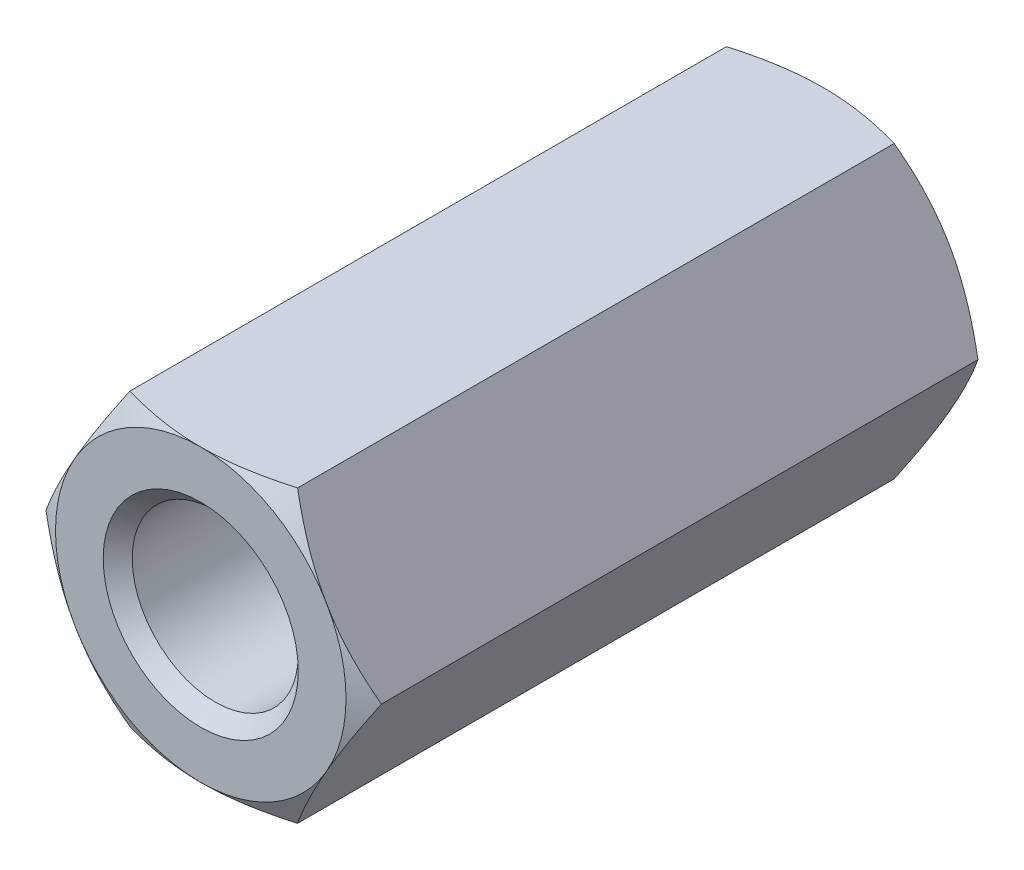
ISO-10303-21;
HEADER;
FILE_DESCRIPTION(('STEP AP214'),'2;1');
FILE_NAME('part.step','',(''),(''),'','','');
FILE_SCHEMA(('AUTOMOTIVE_DESIGN { 1 0 10303 214 1 1 1 1 }'));
ENDSEC;
DATA;
#1=APPLICATION_CONTEXT('core data for automotive mechanical design processes');
#2=APPLICATION_PROTOCOL_DEFINITION('international standard','automotive_design',2000,#1);
#3=PRODUCT_CONTEXT('',#1,'mechanical');
#4=PRODUCT('Part','Part','',(#3));
#5=PRODUCT_RELATED_PRODUCT_CATEGORY('part','',(#4));
#6=PRODUCT_DEFINITION_FORMATION('','',#4);
#7=PRODUCT_DEFINITION_CONTEXT('part definition',#1,'design');
#8=PRODUCT_DEFINITION('design','',#6,#7);
#9=PRODUCT_DEFINITION_SHAPE('','',#8);
#10=(LENGTH_UNIT() NAMED_UNIT(*) SI_UNIT(.MILLI.,.METRE.));
#11=(NAMED_UNIT(*) PLANE_ANGLE_UNIT() SI_UNIT($,.RADIAN.));
#12=(NAMED_UNIT(*) SI_UNIT($,.STERADIAN.) SOLID_ANGLE_UNIT());
#13=UNCERTAINTY_MEASURE_WITH_UNIT(LENGTH_MEASURE(1.E-05),#10,'distance_accuracy_value','');
#14=(GEOMETRIC_REPRESENTATION_CONTEXT(3) GLOBAL_UNCERTAINTY_ASSIGNED_CONTEXT((#13)) GLOBAL_UNIT_ASSIGNED_CONTEXT((#10,
#11,#12)) REPRESENTATION_CONTEXT('',''));
#15=CARTESIAN_POINT('',(0.,0.,0.));
#16=DIRECTION('',(0.,0.,1.));
#17=DIRECTION('',(1.,0.,0.));
#18=AXIS2_PLACEMENT_3D('',#15,#16,#17);
#19=CARTESIAN_POINT('',(4.04145188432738,0.,-7.5));
#20=DIRECTION('',(0.866025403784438,0.5,0.));
#21=DIRECTION('',(-0.5,0.866025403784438,0.));
#22=AXIS2_PLACEMENT_3D('',#19,#20,#21);
#23=PLANE('',#22);
#24=CARTESIAN_POINT('',(4.04156735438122,-0.00019999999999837,7.18732593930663));
#25=CARTESIAN_POINT('',(3.9527667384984,0.153607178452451,7.23861421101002));
#26=CARTESIAN_POINT('',(3.86319960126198,0.308742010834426,7.2852590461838));
#27=CARTESIAN_POINT('',(3.68251437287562,0.621698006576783,7.36667812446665));
#28=CARTESIAN_POINT('',(3.59139307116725,0.779524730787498,7.40142356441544));
#29=CARTESIAN_POINT('',(3.41027974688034,1.09322221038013,7.45550997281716));
#30=CARTESIAN_POINT('',(3.32031559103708,1.24904469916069,7.47521091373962));
#31=CARTESIAN_POINT('',(3.13996396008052,1.56142288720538,7.49872986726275));
#32=CARTESIAN_POINT('',(3.04957714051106,1.71797745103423,7.50256735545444));
#33=CARTESIAN_POINT('',(2.88068384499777,2.01050921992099,7.49458469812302));
#34=CARTESIAN_POINT('',(2.80215208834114,2.14653021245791,7.48472456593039));
#35=CARTESIAN_POINT('',(2.64560020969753,2.417686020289,7.4534735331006));
#36=CARTESIAN_POINT('',(2.5675806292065,2.55281989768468,7.4320719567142));
#37=CARTESIAN_POINT('',(2.41070596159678,2.82453479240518,7.37856959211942));
#38=CARTESIAN_POINT('',(2.33187072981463,2.96108141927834,7.34624200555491));
#39=CARTESIAN_POINT('',(2.17537608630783,3.2321380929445,7.27287106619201));
#40=CARTESIAN_POINT('',(2.09771466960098,3.36665161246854,7.23184495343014));
#41=CARTESIAN_POINT('',(2.02061047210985,3.5002,7.18732593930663));
#42=B_SPLINE_CURVE_WITH_KNOTS('',3,(#24,#25,#26,#27,#28,#29,#30,#31,#32,#33,#34,#35,#36,#37,#38,
#39,#40,#41),.UNSPECIFIED.,.F.,.F.,(4,2,2,2,2,2,2,2,4),(0.,0.554793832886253,1.11092123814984,
1.65328467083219,2.19498204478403,2.6666513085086,3.13875761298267,3.6213361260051,
4.10296698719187),.UNSPECIFIED.);
#43=CARTESIAN_POINT('',(4.04145188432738,0.,7.18739260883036));
#44=VERTEX_POINT('',#43);
#45=CARTESIAN_POINT('',(3.03108891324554,1.75,7.5));
#46=VERTEX_POINT('',#45);
#47=EDGE_CURVE('E127',#44,#46,#42,.T.);
#48=ORIENTED_EDGE('',*,*,#47,.F.);
#49=DIRECTION('',(0.,0.,1.));
#50=VECTOR('',#49,1.);
#51=CARTESIAN_POINT('',(4.04145188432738,0.,-7.5));
#52=LINE('',#51,#50);
#53=CARTESIAN_POINT('',(4.04145188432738,0.,-7.18739260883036));
#54=VERTEX_POINT('',#53);
#55=EDGE_CURVE('E549',#54,#44,#52,.T.);
#56=ORIENTED_EDGE('',*,*,#55,.F.);
#57=CARTESIAN_POINT('',(4.04156735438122,-0.00019999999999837,-7.18732593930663));
#58=CARTESIAN_POINT('',(3.9527667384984,0.153607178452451,-7.23861421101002));
#59=CARTESIAN_POINT('',(3.86319960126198,0.308742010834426,-7.2852590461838));
#60=CARTESIAN_POINT('',(3.68251437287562,0.621698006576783,-7.36667812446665));
#61=CARTESIAN_POINT('',(3.59139307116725,0.779524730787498,-7.40142356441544));
#62=CARTESIAN_POINT('',(3.41027974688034,1.09322221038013,-7.45550997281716));
#63=CARTESIAN_POINT('',(3.32031559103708,1.24904469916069,-7.47521091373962));
#64=CARTESIAN_POINT('',(3.13996396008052,1.56142288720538,-7.49872986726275));
#65=CARTESIAN_POINT('',(3.04957714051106,1.71797745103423,-7.50256735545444));
#66=CARTESIAN_POINT('',(2.88068384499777,2.01050921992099,-7.49458469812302));
#67=CARTESIAN_POINT('',(2.80215208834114,2.14653021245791,-7.48472456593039));
#68=CARTESIAN_POINT('',(2.64560020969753,2.417686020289,-7.4534735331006));
#69=CARTESIAN_POINT('',(2.5675806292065,2.55281989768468,-7.4320719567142));
#70=CARTESIAN_POINT('',(2.41070596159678,2.82453479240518,-7.37856959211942));
#71=CARTESIAN_POINT('',(2.33187072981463,2.96108141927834,-7.34624200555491));
#72=CARTESIAN_POINT('',(2.17537608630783,3.2321380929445,-7.27287106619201));
#73=CARTESIAN_POINT('',(2.09771466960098,3.36665161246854,-7.23184495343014));
#74=CARTESIAN_POINT('',(2.02061047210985,3.5002,-7.18732593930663));
#75=B_SPLINE_CURVE_WITH_KNOTS('',3,(#57,#58,#59,#60,#61,#62,#63,#64,#65,#66,#67,#68,#69,#70,#71,
#72,#73,#74),.UNSPECIFIED.,.F.,.F.,(4,2,2,2,2,2,2,2,4),(0.,0.554793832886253,1.11092123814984,
1.65328467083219,2.19498204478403,2.6666513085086,3.13875761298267,3.6213361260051,
4.10296698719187),.UNSPECIFIED.);
#76=CARTESIAN_POINT('',(3.03108891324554,1.75,-7.5));
#77=VERTEX_POINT('',#76);
#78=EDGE_CURVE('E530',#54,#77,#75,.T.);
#79=ORIENTED_EDGE('',*,*,#78,.T.);
#80=CARTESIAN_POINT('',(2.02072594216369,3.5,-7.18739260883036));
#81=VERTEX_POINT('',#80);
#82=EDGE_CURVE('E268',#77,#81,#75,.T.);
#83=ORIENTED_EDGE('',*,*,#82,.T.);
#84=DIRECTION('',(0.,0.,1.));
#85=VECTOR('',#84,1.);
#86=CARTESIAN_POINT('',(2.02072594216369,3.5,-7.5));
#87=LINE('',#86,#85);
#88=CARTESIAN_POINT('',(2.02072594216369,3.5,7.18739260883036));
#89=VERTEX_POINT('',#88);
#90=EDGE_CURVE('E159',#81,#89,#87,.T.);
#91=ORIENTED_EDGE('',*,*,#90,.T.);
#92=EDGE_CURVE('E140',#46,#89,#42,.T.);
#93=ORIENTED_EDGE('',*,*,#92,.F.);
#94=EDGE_LOOP('',(#48,#56,#79,#83,#91,#93));
#95=FACE_BOUND('',#94,.T.);
#96=ADVANCED_FACE('F41',(#95),#23,.T.);
#97=CARTESIAN_POINT('',(2.02072594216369,-3.5,-7.5));
#98=DIRECTION('',(0.866025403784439,-0.5,0.));
#99=DIRECTION('',(0.5,0.866025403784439,0.));
#100=AXIS2_PLACEMENT_3D('',#97,#98,#99);
#101=PLANE('',#100);
#102=CARTESIAN_POINT('',(2.02061047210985,-3.5002,7.18732593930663));
#103=CARTESIAN_POINT('',(2.10941108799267,-3.34639282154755,7.23861421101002));
#104=CARTESIAN_POINT('',(2.19897822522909,-3.19125798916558,7.2852590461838));
#105=CARTESIAN_POINT('',(2.37966345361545,-2.87830199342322,7.36667812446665));
#106=CARTESIAN_POINT('',(2.47078475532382,-2.7204752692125,7.40142356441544));
#107=CARTESIAN_POINT('',(2.65189807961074,-2.40677778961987,7.45550997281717));
#108=CARTESIAN_POINT('',(2.74186223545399,-2.25095530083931,7.47521091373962));
#109=CARTESIAN_POINT('',(2.92221386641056,-1.93857711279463,7.49872986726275));
#110=CARTESIAN_POINT('',(3.01260068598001,-1.78202254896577,7.50256735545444));
#111=CARTESIAN_POINT('',(3.1814939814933,-1.48949078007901,7.49458469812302));
#112=CARTESIAN_POINT('',(3.26002573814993,-1.35346978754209,7.48472456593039));
#113=CARTESIAN_POINT('',(3.41657761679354,-1.082313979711,7.4534735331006));
#114=CARTESIAN_POINT('',(3.49459719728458,-0.947180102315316,7.4320719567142));
#115=CARTESIAN_POINT('',(3.65147186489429,-0.675465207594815,7.37856959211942));
#116=CARTESIAN_POINT('',(3.73030709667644,-0.538918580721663,7.34624200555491));
#117=CARTESIAN_POINT('',(3.88680174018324,-0.267861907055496,7.27287106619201));
#118=CARTESIAN_POINT('',(3.96446315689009,-0.133348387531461,7.23184495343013));
#119=CARTESIAN_POINT('',(4.04156735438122,0.000200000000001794,7.18732593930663));
#120=B_SPLINE_CURVE_WITH_KNOTS('',3,(#102,#103,#104,#105,#106,#107,#108,#109,#110,#111,#112,
#113,#114,#115,#116,#117,#118,#119),.UNSPECIFIED.,.F.,.F.,(4,2,2,2,2,2,2,2,4),(0.,
0.554793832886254,1.11092123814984,1.65328467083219,2.19498204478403,2.6666513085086,
3.13875761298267,3.6213361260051,4.10296698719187),.UNSPECIFIED.);
#121=CARTESIAN_POINT('',(2.02072594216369,-3.5,7.18739260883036));
#122=VERTEX_POINT('',#121);
#123=CARTESIAN_POINT('',(3.03108891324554,-1.75,7.5));
#124=VERTEX_POINT('',#123);
#125=EDGE_CURVE('E576',#122,#124,#120,.T.);
#126=ORIENTED_EDGE('',*,*,#125,.F.);
#127=DIRECTION('',(0.,0.,1.));
#128=VECTOR('',#127,1.);
#129=CARTESIAN_POINT('',(2.02072594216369,-3.5,-7.5));
#130=LINE('',#129,#128);
#131=CARTESIAN_POINT('',(2.02072594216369,-3.5,-7.18739260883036));
#132=VERTEX_POINT('',#131);
#133=EDGE_CURVE('E282',#132,#122,#130,.T.);
#134=ORIENTED_EDGE('',*,*,#133,.F.);
#135=CARTESIAN_POINT('',(2.02061047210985,-3.5002,-7.18732593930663));
#136=CARTESIAN_POINT('',(2.10941108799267,-3.34639282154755,-7.23861421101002));
#137=CARTESIAN_POINT('',(2.19897822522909,-3.19125798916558,-7.2852590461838));
#138=CARTESIAN_POINT('',(2.37966345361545,-2.87830199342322,-7.36667812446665));
#139=CARTESIAN_POINT('',(2.47078475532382,-2.7204752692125,-7.40142356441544));
#140=CARTESIAN_POINT('',(2.65189807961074,-2.40677778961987,-7.45550997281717));
#141=CARTESIAN_POINT('',(2.74186223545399,-2.25095530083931,-7.47521091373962));
#142=CARTESIAN_POINT('',(2.92221386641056,-1.93857711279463,-7.49872986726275));
#143=CARTESIAN_POINT('',(3.01260068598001,-1.78202254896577,-7.50256735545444));
#144=CARTESIAN_POINT('',(3.1814939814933,-1.48949078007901,-7.49458469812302));
#145=CARTESIAN_POINT('',(3.26002573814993,-1.35346978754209,-7.48472456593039));
#146=CARTESIAN_POINT('',(3.41657761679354,-1.082313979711,-7.4534735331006));
#147=CARTESIAN_POINT('',(3.49459719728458,-0.947180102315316,-7.4320719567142));
#148=CARTESIAN_POINT('',(3.65147186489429,-0.675465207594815,-7.37856959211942));
#149=CARTESIAN_POINT('',(3.73030709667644,-0.538918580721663,-7.34624200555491));
#150=CARTESIAN_POINT('',(3.88680174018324,-0.267861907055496,-7.27287106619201));
#151=CARTESIAN_POINT('',(3.96446315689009,-0.133348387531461,-7.23184495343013));
#152=CARTESIAN_POINT('',(4.04156735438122,0.000200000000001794,-7.18732593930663));
#153=B_SPLINE_CURVE_WITH_KNOTS('',3,(#135,#136,#137,#138,#139,#140,#141,#142,#143,#144,#145,
#146,#147,#148,#149,#150,#151,#152),.UNSPECIFIED.,.F.,.F.,(4,2,2,2,2,2,2,2,4),(0.,
0.554793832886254,1.11092123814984,1.65328467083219,2.19498204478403,2.6666513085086,
3.13875761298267,3.6213361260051,4.10296698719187),.UNSPECIFIED.);
#154=CARTESIAN_POINT('',(3.03108891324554,-1.75,-7.5));
#155=VERTEX_POINT('',#154);
#156=EDGE_CURVE('E528',#132,#155,#153,.T.);
#157=ORIENTED_EDGE('',*,*,#156,.T.);
#158=EDGE_CURVE('E283',#155,#54,#153,.T.);
#159=ORIENTED_EDGE('',*,*,#158,.T.);
#160=ORIENTED_EDGE('',*,*,#55,.T.);
#161=EDGE_CURVE('E132',#124,#44,#120,.T.);
#162=ORIENTED_EDGE('',*,*,#161,.F.);
#163=EDGE_LOOP('',(#126,#134,#157,#159,#160,#162));
#164=FACE_BOUND('',#163,.T.);
#165=ADVANCED_FACE('F253',(#164),#101,.T.);
#166=CARTESIAN_POINT('',(-2.02072594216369,-3.5,-7.5));
#167=DIRECTION('',(0.,-1.,0.));
#168=DIRECTION('',(1.,0.,0.));
#169=AXIS2_PLACEMENT_3D('',#166,#167,#168);
#170=PLANE('',#169);
#171=CARTESIAN_POINT('',(-13.93909338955,-3.50000000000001,1.22316958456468));
#172=CARTESIAN_POINT('',(-13.6340370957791,-3.50000000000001,1.3939836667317));
#173=CARTESIAN_POINT('',(-13.328844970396,-3.5,1.56455582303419));
#174=CARTESIAN_POINT('',(-12.7181143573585,-3.5,1.90508295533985));
#175=CARTESIAN_POINT('',(-12.412575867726,-3.5,2.07503792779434));
#176=CARTESIAN_POINT('',(-11.8010010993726,-3.5,2.41423989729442));
#177=CARTESIAN_POINT('',(-11.4949647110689,-3.5,2.58348669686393));
#178=CARTESIAN_POINT('',(-10.8823730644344,-3.5,2.92103734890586));
#179=CARTESIAN_POINT('',(-10.5758178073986,-3.5,3.08934120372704));
#180=CARTESIAN_POINT('',(-9.96272869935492,-3.5,3.42438286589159));
#181=CARTESIAN_POINT('',(-9.65619628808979,-3.5,3.59112330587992));
#182=CARTESIAN_POINT('',(-9.04229742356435,-3.5,3.92306138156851));
#183=CARTESIAN_POINT('',(-8.73493097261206,-3.5,4.0882590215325));
#184=CARTESIAN_POINT('',(-8.11914738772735,-3.5,4.4165906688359));
#185=CARTESIAN_POINT('',(-7.8107303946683,-3.5,4.57972494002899));
#186=CARTESIAN_POINT('',(-7.19244579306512,-3.5,4.90321772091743));
#187=CARTESIAN_POINT('',(-6.88257820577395,-3.5,5.06357627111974));
#188=CARTESIAN_POINT('',(-6.26306488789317,-3.5,5.37927240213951));
#189=CARTESIAN_POINT('',(-5.95343325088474,-3.5,5.53463757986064));
#190=CARTESIAN_POINT('',(-5.33137168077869,-3.5,5.83985440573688));
#191=CARTESIAN_POINT('',(-5.01894126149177,-3.5,5.98970507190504));
#192=CARTESIAN_POINT('',(-4.54653144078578,-3.5,6.20851819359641));
#193=CARTESIAN_POINT('',(-4.388017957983,-3.5,6.28064138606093));
#194=CARTESIAN_POINT('',(-4.06979128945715,-3.5,6.42218453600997));
#195=CARTESIAN_POINT('',(-3.91007814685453,-3.5,6.49160459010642));
#196=CARTESIAN_POINT('',(-3.58923189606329,-3.5,6.62701995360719));
#197=CARTESIAN_POINT('',(-3.42809904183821,-3.5,6.6930158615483));
#198=CARTESIAN_POINT('',(-3.10411792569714,-3.5,6.82063180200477));
#199=CARTESIAN_POINT('',(-2.9412697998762,-3.5,6.88225217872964));
#200=CARTESIAN_POINT('',(-2.57330185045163,-3.5,7.0143159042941));
#201=CARTESIAN_POINT('',(-2.36761759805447,-3.5,7.08321234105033));
#202=CARTESIAN_POINT('',(-1.95256058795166,-3.5,7.20906629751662));
#203=CARTESIAN_POINT('',(-1.74318771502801,-3.5,7.26602344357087));
#204=CARTESIAN_POINT('',(-1.32302041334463,-3.5,7.36326256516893));
#205=CARTESIAN_POINT('',(-1.11227086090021,-3.5,7.40373082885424));
#206=CARTESIAN_POINT('',(-0.79404941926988,-3.5,7.44950044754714));
#207=CARTESIAN_POINT('',(-0.687633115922,-3.5,7.46226784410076));
#208=CARTESIAN_POINT('',(-0.474299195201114,-3.5,7.48243383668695));
#209=CARTESIAN_POINT('',(-0.36738165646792,-3.5,7.48983324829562));
#210=CARTESIAN_POINT('',(-0.151941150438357,-3.5,7.4990600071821));
#211=CARTESIAN_POINT('',(-0.0434150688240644,-3.5,7.50081524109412));
#212=CARTESIAN_POINT('',(0.173574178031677,-3.5,7.49848616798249));
#213=CARTESIAN_POINT('',(0.282037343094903,-3.5,7.49440184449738));
#214=CARTESIAN_POINT('',(0.498618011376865,-3.5,7.480543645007));
#215=CARTESIAN_POINT('',(0.606735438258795,-3.5,7.47076858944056));
#216=CARTESIAN_POINT('',(0.822348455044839,-3.5,7.44586892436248));
#217=CARTESIAN_POINT('',(0.929844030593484,-3.5,7.4307441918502));
#218=CARTESIAN_POINT('',(1.14527612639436,-3.5,7.39541323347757));
#219=CARTESIAN_POINT('',(1.25320318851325,-3.5,7.37514984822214));
#220=CARTESIAN_POINT('',(1.46812360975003,-3.5,7.33018935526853));
#221=CARTESIAN_POINT('',(1.57511695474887,-3.5,7.30549218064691));
#222=CARTESIAN_POINT('',(1.78815137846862,-3.5,7.25222711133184));
#223=CARTESIAN_POINT('',(1.89419226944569,-3.5,7.22365847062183));
#224=CARTESIAN_POINT('',(2.10530694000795,-3.5,7.16319017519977));
#225=CARTESIAN_POINT('',(2.21038077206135,-3.5,7.13129070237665));
#226=CARTESIAN_POINT('',(2.51184829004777,-3.5,7.03527758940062));
#227=CARTESIAN_POINT('',(2.70709295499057,-3.5,6.9675545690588));
#228=CARTESIAN_POINT('',(3.09486410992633,-3.5,6.82468449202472));
#229=CARTESIAN_POINT('',(3.28738980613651,-3.5,6.74953531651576));
#230=CARTESIAN_POINT('',(3.67037650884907,-3.5,6.59365624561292));
#231=CARTESIAN_POINT('',(3.86083529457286,-3.5,6.51292092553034));
#232=CARTESIAN_POINT('',(4.23991407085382,-3.5,6.34731909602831));
#233=CARTESIAN_POINT('',(4.42853424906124,-3.5,6.2624530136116));
#234=CARTESIAN_POINT('',(4.80483432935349,-3.5,6.08932784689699));
#235=CARTESIAN_POINT('',(4.99251022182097,-3.5,6.00106007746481));
#236=CARTESIAN_POINT('',(5.36668445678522,-3.5,5.82206064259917));
#237=CARTESIAN_POINT('',(5.55318277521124,-3.5,5.73132892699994));
#238=CARTESIAN_POINT('',(6.11104952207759,-3.5,5.45636200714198));
#239=CARTESIAN_POINT('',(6.48100139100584,-3.5,5.26925607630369));
#240=CARTESIAN_POINT('',(7.21924313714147,-3.5,4.8896905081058));
#241=CARTESIAN_POINT('',(7.58752697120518,-3.5,4.69721919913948));
#242=CARTESIAN_POINT('',(8.32236027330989,-3.5,4.30888661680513));
#243=CARTESIAN_POINT('',(8.68890951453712,-3.5,4.11302491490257));
#244=CARTESIAN_POINT('',(9.42018483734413,-3.5,3.71921501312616));
#245=CARTESIAN_POINT('',(9.78491281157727,-3.5,3.52127032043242));
#246=CARTESIAN_POINT('',(10.5134214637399,-3.5,3.1236447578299));
#247=CARTESIAN_POINT('',(10.8772021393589,-3.5,2.92396388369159));
#248=CARTESIAN_POINT('',(11.4663032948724,-3.5,2.59922228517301));
#249=CARTESIAN_POINT('',(11.6918455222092,-3.5,2.47456335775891));
#250=CARTESIAN_POINT('',(12.1427515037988,-3.5,2.22478250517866));
#251=CARTESIAN_POINT('',(12.368115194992,-3.5,2.09966046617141));
#252=CARTESIAN_POINT('',(12.8178779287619,-3.5,1.84947273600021));
#253=CARTESIAN_POINT('',(13.0422776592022,-3.5,1.72440828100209));
#254=CARTESIAN_POINT('',(13.4908410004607,-3.5,1.4739969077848));
#255=CARTESIAN_POINT('',(13.7150046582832,-3.5,1.34865007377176));
#256=CARTESIAN_POINT('',(13.93909338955,-3.5,1.22316958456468));
#257=B_SPLINE_CURVE_WITH_KNOTS('',3,(#171,#172,#173,#174,#175,#176,#177,#178,#179,#180,#181,
#182,#183,#184,#185,#186,#187,#188,#189,#190,#191,#192,#193,#194,#195,#196,#197,#198,#199,#200,
#201,#202,#203,#204,#205,#206,#207,#208,#209,#210,#211,#212,#213,#214,#215,#216,#217,#218,#219,
#220,#221,#222,#223,#224,#225,#226,#227,#228,#229,#230,#231,#232,#233,#234,#235,#236,#237,#238,
#239,#240,#241,#242,#243,#244,#245,#246,#247,#248,#249,#250,#251,#252,#253,#254,#255,#256),
.UNSPECIFIED.,.F.,.F.,(4,2,2,2,2,2,2,2,2,2,2,2,2,2,2,2,2,2,2,2,2,2,2,2,2,2,2,2,2,2,2,2,2,2,2,2,
2,2,2,2,2,2,4),(0.,1.04887173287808,2.09774948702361,3.14690246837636,4.19605283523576,
5.24289261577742,6.28972950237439,7.33643114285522,8.383117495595,9.4223602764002,
10.4617872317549,10.9842185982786,11.5066312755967,12.0289523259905,12.551232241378,
13.2017093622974,13.8522068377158,14.4951364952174,14.8165592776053,15.1379332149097,
15.4633972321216,15.788862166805,16.1143945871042,16.4399344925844,16.7692678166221,
17.0986061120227,17.4280079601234,17.7573918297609,18.3771299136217,18.9970453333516,
19.6175714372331,20.2380335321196,20.8602010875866,21.4823813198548,22.726041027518,
23.9726577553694,25.2194332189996,26.464368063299,27.7093059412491,28.482404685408,
29.2557081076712,30.0264005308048,30.7968874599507),.UNSPECIFIED.);
#258=CARTESIAN_POINT('',(-2.02072594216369,-3.5,7.18739260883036));
#259=VERTEX_POINT('',#258);
#260=CARTESIAN_POINT('',(0.,-3.5,7.5));
#261=VERTEX_POINT('',#260);
#262=EDGE_CURVE('E577',#259,#261,#257,.T.);
#263=ORIENTED_EDGE('',*,*,#262,.F.);
#264=DIRECTION('',(0.,0.,1.));
#265=VECTOR('',#264,1.);
#266=CARTESIAN_POINT('',(-2.02072594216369,-3.5,-7.5));
#267=LINE('',#266,#265);
#268=CARTESIAN_POINT('',(-2.02072594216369,-3.5,-7.18739260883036));
#269=VERTEX_POINT('',#268);
#270=EDGE_CURVE('E544',#269,#259,#267,.T.);
#271=ORIENTED_EDGE('',*,*,#270,.F.);
#272=CARTESIAN_POINT('',(-9.33049178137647,-3.5,-3.76723202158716));
#273=CARTESIAN_POINT('',(-9.12157214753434,-3.5,-3.88015785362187));
#274=CARTESIAN_POINT('',(-8.91246384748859,-3.5,-3.99273652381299));
#275=CARTESIAN_POINT('',(-8.49377211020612,-3.5,-4.21701727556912));
#276=CARTESIAN_POINT('',(-8.28418866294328,-3.5,-4.32871933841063));
#277=CARTESIAN_POINT('',(-7.8642827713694,-3.5,-4.5511524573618));
#278=CARTESIAN_POINT('',(-7.65395985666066,-3.5,-4.66188262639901));
#279=CARTESIAN_POINT('',(-7.23262389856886,-3.5,-4.88201911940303));
#280=CARTESIAN_POINT('',(-7.02161086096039,-3.5,-4.99142545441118));
#281=CARTESIAN_POINT('',(-6.59086219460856,-3.5,-5.21261713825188));
#282=CARTESIAN_POINT('',(-6.37109417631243,-3.5,-5.32433951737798));
#283=CARTESIAN_POINT('',(-5.9304017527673,-3.5,-5.54547846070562));
#284=CARTESIAN_POINT('',(-5.70947736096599,-3.5,-5.65489505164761));
#285=CARTESIAN_POINT('',(-5.26622241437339,-3.5,-5.87066288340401));
#286=CARTESIAN_POINT('',(-5.04389234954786,-3.5,-5.97701512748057));
#287=CARTESIAN_POINT('',(-4.59733510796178,-3.5,-6.18564648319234));
#288=CARTESIAN_POINT('',(-4.3731080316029,-3.5,-6.28792580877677));
#289=CARTESIAN_POINT('',(-3.91084029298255,-3.5,-6.49190379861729));
#290=CARTESIAN_POINT('',(-3.67267177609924,-3.5,-6.59331491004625));
#291=CARTESIAN_POINT('',(-3.19266309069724,-3.5,-6.7873707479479));
#292=CARTESIAN_POINT('',(-2.95082188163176,-3.5,-6.88001293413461));
#293=CARTESIAN_POINT('',(-2.46512134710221,-3.5,-7.0515649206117));
#294=CARTESIAN_POINT('',(-2.2213105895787,-3.5,-7.13060987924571));
#295=CARTESIAN_POINT('',(-1.72844756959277,-3.5,-7.27041855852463));
#296=CARTESIAN_POINT('',(-1.47939830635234,-3.5,-7.33119245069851));
#297=CARTESIAN_POINT('',(-1.03659094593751,-3.5,-7.41580892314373));
#298=CARTESIAN_POINT('',(-0.843878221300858,-3.5,-7.44501080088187));
#299=CARTESIAN_POINT('',(-0.456608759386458,-3.5,-7.4858342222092));
#300=CARTESIAN_POINT('',(-0.262052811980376,-3.5,-7.49746298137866));
#301=CARTESIAN_POINT('',(0.127275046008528,-3.5,-7.50178797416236));
#302=CARTESIAN_POINT('',(0.322046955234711,-3.5,-7.49448432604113));
#303=CARTESIAN_POINT('',(0.710055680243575,-3.5,-7.46182228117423));
#304=CARTESIAN_POINT('',(0.903292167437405,-3.5,-7.43646011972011));
#305=CARTESIAN_POINT('',(1.29192554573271,-3.5,-7.36946918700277));
#306=CARTESIAN_POINT('',(1.48725172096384,-3.5,-7.32744180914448));
#307=CARTESIAN_POINT('',(1.87472606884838,-3.5,-7.23060011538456));
#308=CARTESIAN_POINT('',(2.06687275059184,-3.5,-7.1757799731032));
#309=CARTESIAN_POINT('',(2.44856990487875,-3.5,-7.05633300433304));
#310=CARTESIAN_POINT('',(2.63811272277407,-3.5,-6.99168210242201));
#311=CARTESIAN_POINT('',(3.01450726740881,-3.5,-6.85515357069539));
#312=CARTESIAN_POINT('',(3.20135949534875,-3.5,-6.78327730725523));
#313=CARTESIAN_POINT('',(3.57599656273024,-3.5,-6.63285827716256));
#314=CARTESIAN_POINT('',(3.76374428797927,-3.5,-6.55422376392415));
#315=CARTESIAN_POINT('',(4.13741474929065,-3.5,-6.39274115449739));
#316=CARTESIAN_POINT('',(4.32333743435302,-3.5,-6.30989294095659));
#317=CARTESIAN_POINT('',(4.69345130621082,-3.5,-6.14109919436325));
#318=CARTESIAN_POINT('',(4.8776445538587,-3.5,-6.05515816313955));
#319=CARTESIAN_POINT('',(5.24484143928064,-3.5,-5.88078593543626));
#320=CARTESIAN_POINT('',(5.42784509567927,-3.5,-5.79235477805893));
#321=CARTESIAN_POINT('',(5.92869014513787,-3.5,-5.54702822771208));
#322=CARTESIAN_POINT('',(6.245555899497,-3.5,-5.38814334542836));
#323=CARTESIAN_POINT('',(6.87734173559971,-3.5,-5.0662942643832));
#324=CARTESIAN_POINT('',(7.19226107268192,-3.5,-4.90332861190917));
#325=CARTESIAN_POINT('',(7.8116992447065,-3.5,-4.5792039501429));
#326=CARTESIAN_POINT('',(8.11625987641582,-3.5,-4.41812465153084));
#327=CARTESIAN_POINT('',(8.72416943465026,-3.5,-4.09400216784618));
#328=CARTESIAN_POINT('',(9.02751882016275,-3.5,-3.93095984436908));
#329=CARTESIAN_POINT('',(9.33049178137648,-3.5,-3.76723202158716));
#330=B_SPLINE_CURVE_WITH_KNOTS('',3,(#272,#273,#274,#275,#276,#277,#278,#279,#280,#281,#282,
#283,#284,#285,#286,#287,#288,#289,#290,#291,#292,#293,#294,#295,#296,#297,#298,#299,#300,#301,
#302,#303,#304,#305,#306,#307,#308,#309,#310,#311,#312,#313,#314,#315,#316,#317,#318,#319,#320,
#321,#322,#323,#324,#325,#326,#327,#328,#329),.UNSPECIFIED.,.F.,.F.,(4,2,2,2,2,2,2,2,2,2,2,2,2,
2,2,2,2,2,2,2,2,2,2,2,2,2,2,2,4),(0.,0.712459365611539,1.42493390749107,2.13800238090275,
2.85106490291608,3.59066178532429,4.33025008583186,5.06959342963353,5.80889788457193,
6.58536007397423,7.36204651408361,8.13049979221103,8.89852447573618,9.48258230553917,
10.0664002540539,10.6502145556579,11.2341506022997,11.8329887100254,12.4321000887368,
13.032703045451,13.6331926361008,14.24377549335,14.854375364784,15.464119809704,
16.0738546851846,17.1372136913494,18.2009570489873,19.2345504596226,20.2677056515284),.UNSPECIFIED.);
#331=CARTESIAN_POINT('',(0.,-3.5,-7.5));
#332=VERTEX_POINT('',#331);
#333=EDGE_CURVE('E553',#269,#332,#330,.T.);
#334=ORIENTED_EDGE('',*,*,#333,.T.);
#335=EDGE_CURVE('E258',#332,#132,#330,.T.);
#336=ORIENTED_EDGE('',*,*,#335,.T.);
#337=ORIENTED_EDGE('',*,*,#133,.T.);
#338=EDGE_CURVE('E138',#261,#122,#257,.T.);
#339=ORIENTED_EDGE('',*,*,#338,.F.);
#340=EDGE_LOOP('',(#263,#271,#334,#336,#337,#339));
#341=FACE_BOUND('',#340,.T.);
#342=ADVANCED_FACE('F291',(#341),#170,.T.);
#343=CARTESIAN_POINT('',(-4.04145188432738,0.,-7.5));
#344=DIRECTION('',(-0.866025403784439,-0.5,0.));
#345=DIRECTION('',(0.5,-0.866025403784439,0.));
#346=AXIS2_PLACEMENT_3D('',#343,#344,#345);
#347=PLANE('',#346);
#348=CARTESIAN_POINT('',(-4.04156735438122,0.000199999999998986,7.18732593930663));
#349=CARTESIAN_POINT('',(-3.9527667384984,-0.15360717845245,7.23861421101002));
#350=CARTESIAN_POINT('',(-3.86319960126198,-0.308742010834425,7.28525904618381));
#351=CARTESIAN_POINT('',(-3.68251437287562,-0.621698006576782,7.36667812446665));
#352=CARTESIAN_POINT('',(-3.59139307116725,-0.779524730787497,7.40142356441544));
#353=CARTESIAN_POINT('',(-3.41027974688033,-1.09322221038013,7.45550997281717));
#354=CARTESIAN_POINT('',(-3.32031559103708,-1.24904469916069,7.47521091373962));
#355=CARTESIAN_POINT('',(-3.13996396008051,-1.56142288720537,7.49872986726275));
#356=CARTESIAN_POINT('',(-3.04957714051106,-1.71797745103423,7.50256735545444));
#357=CARTESIAN_POINT('',(-2.88068384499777,-2.01050921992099,7.49458469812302));
#358=CARTESIAN_POINT('',(-2.80215208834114,-2.14653021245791,7.48472456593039));
#359=CARTESIAN_POINT('',(-2.64560020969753,-2.41768602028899,7.4534735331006));
#360=CARTESIAN_POINT('',(-2.56758062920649,-2.55281989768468,7.4320719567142));
#361=CARTESIAN_POINT('',(-2.41070596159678,-2.82453479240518,7.37856959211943));
#362=CARTESIAN_POINT('',(-2.33187072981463,-2.96108141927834,7.34624200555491));
#363=CARTESIAN_POINT('',(-2.17537608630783,-3.2321380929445,7.27287106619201));
#364=CARTESIAN_POINT('',(-2.09771466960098,-3.36665161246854,7.23184495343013));
#365=CARTESIAN_POINT('',(-2.02061047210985,-3.5002,7.18732593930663));
#366=B_SPLINE_CURVE_WITH_KNOTS('',3,(#348,#349,#350,#351,#352,#353,#354,#355,#356,#357,#358,
#359,#360,#361,#362,#363,#364,#365),.UNSPECIFIED.,.F.,.F.,(4,2,2,2,2,2,2,2,4),(0.,
0.554793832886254,1.11092123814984,1.65328467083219,2.19498204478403,2.6666513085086,
3.13875761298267,3.6213361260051,4.10296698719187),.UNSPECIFIED.);
#367=CARTESIAN_POINT('',(-4.04145188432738,0.,7.18739260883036));
#368=VERTEX_POINT('',#367);
#369=CARTESIAN_POINT('',(-3.03108891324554,-1.75,7.5));
#370=VERTEX_POINT('',#369);
#371=EDGE_CURVE('E175',#368,#370,#366,.T.);
#372=ORIENTED_EDGE('',*,*,#371,.F.);
#373=DIRECTION('',(0.,0.,1.));
#374=VECTOR('',#373,1.);
#375=CARTESIAN_POINT('',(-4.04145188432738,0.,-7.5));
#376=LINE('',#375,#374);
#377=CARTESIAN_POINT('',(-4.04145188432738,0.,-7.18739260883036));
#378=VERTEX_POINT('',#377);
#379=EDGE_CURVE('E541',#378,#368,#376,.T.);
#380=ORIENTED_EDGE('',*,*,#379,.F.);
#381=CARTESIAN_POINT('',(-4.04156735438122,0.000199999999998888,-7.18732593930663));
#382=CARTESIAN_POINT('',(-3.9527667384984,-0.15360717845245,-7.23861421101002));
#383=CARTESIAN_POINT('',(-3.86319960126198,-0.308742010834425,-7.28525904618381));
#384=CARTESIAN_POINT('',(-3.68251437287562,-0.621698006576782,-7.36667812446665));
#385=CARTESIAN_POINT('',(-3.59139307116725,-0.779524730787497,-7.40142356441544));
#386=CARTESIAN_POINT('',(-3.41027974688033,-1.09322221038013,-7.45550997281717));
#387=CARTESIAN_POINT('',(-3.32031559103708,-1.24904469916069,-7.47521091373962));
#388=CARTESIAN_POINT('',(-3.13996396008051,-1.56142288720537,-7.49872986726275));
#389=CARTESIAN_POINT('',(-3.04957714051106,-1.71797745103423,-7.50256735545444));
#390=CARTESIAN_POINT('',(-2.88068384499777,-2.01050921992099,-7.49458469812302));
#391=CARTESIAN_POINT('',(-2.80215208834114,-2.14653021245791,-7.48472456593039));
#392=CARTESIAN_POINT('',(-2.64560020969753,-2.417686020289,-7.4534735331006));
#393=CARTESIAN_POINT('',(-2.56758062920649,-2.55281989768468,-7.4320719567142));
#394=CARTESIAN_POINT('',(-2.41070596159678,-2.82453479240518,-7.37856959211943));
#395=CARTESIAN_POINT('',(-2.33187072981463,-2.96108141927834,-7.34624200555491));
#396=CARTESIAN_POINT('',(-2.17537608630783,-3.2321380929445,-7.27287106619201));
#397=CARTESIAN_POINT('',(-2.09771466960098,-3.36665161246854,-7.23184495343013));
#398=CARTESIAN_POINT('',(-2.02061047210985,-3.5002,-7.18732593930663));
#399=B_SPLINE_CURVE_WITH_KNOTS('',3,(#381,#382,#383,#384,#385,#386,#387,#388,#389,#390,#391,
#392,#393,#394,#395,#396,#397,#398),.UNSPECIFIED.,.F.,.F.,(4,2,2,2,2,2,2,2,4),(0.,
0.554793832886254,1.11092123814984,1.65328467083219,2.19498204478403,2.6666513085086,
3.13875761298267,3.6213361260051,4.10296698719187),.UNSPECIFIED.);
#400=CARTESIAN_POINT('',(-3.03108891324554,-1.75,-7.5));
#401=VERTEX_POINT('',#400);
#402=EDGE_CURVE('E274',#378,#401,#399,.T.);
#403=ORIENTED_EDGE('',*,*,#402,.T.);
#404=EDGE_CURVE('E281',#401,#269,#399,.T.);
#405=ORIENTED_EDGE('',*,*,#404,.T.);
#406=ORIENTED_EDGE('',*,*,#270,.T.);
#407=EDGE_CURVE('E575',#370,#259,#366,.T.);
#408=ORIENTED_EDGE('',*,*,#407,.F.);
#409=EDGE_LOOP('',(#372,#380,#403,#405,#406,#408));
#410=FACE_BOUND('',#409,.T.);
#411=ADVANCED_FACE('F288',(#410),#347,.T.);
#412=CARTESIAN_POINT('',(-2.02072594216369,3.5,-7.5));
#413=DIRECTION('',(-0.866025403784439,0.5,0.));
#414=DIRECTION('',(-0.5,-0.866025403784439,0.));
#415=AXIS2_PLACEMENT_3D('',#412,#413,#414);
#416=PLANE('',#415);
#417=CARTESIAN_POINT('',(-2.02061047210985,3.5002,7.18732593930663));
#418=CARTESIAN_POINT('',(-2.10941108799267,3.34639282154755,7.23861421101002));
#419=CARTESIAN_POINT('',(-2.19897822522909,3.19125798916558,7.2852590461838));
#420=CARTESIAN_POINT('',(-2.37966345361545,2.87830199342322,7.36667812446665));
#421=CARTESIAN_POINT('',(-2.47078475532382,2.7204752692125,7.40142356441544));
#422=CARTESIAN_POINT('',(-2.65189807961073,2.40677778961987,7.45550997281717));
#423=CARTESIAN_POINT('',(-2.74186223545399,2.25095530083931,7.47521091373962));
#424=CARTESIAN_POINT('',(-2.92221386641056,1.93857711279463,7.49872986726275));
#425=CARTESIAN_POINT('',(-3.01260068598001,1.78202254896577,7.50256735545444));
#426=CARTESIAN_POINT('',(-3.1814939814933,1.48949078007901,7.49458469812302));
#427=CARTESIAN_POINT('',(-3.26002573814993,1.35346978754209,7.48472456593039));
#428=CARTESIAN_POINT('',(-3.41657761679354,1.08231397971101,7.4534735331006));
#429=CARTESIAN_POINT('',(-3.49459719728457,0.947180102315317,7.4320719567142));
#430=CARTESIAN_POINT('',(-3.65147186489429,0.675465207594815,7.37856959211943));
#431=CARTESIAN_POINT('',(-3.73030709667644,0.538918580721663,7.34624200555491));
#432=CARTESIAN_POINT('',(-3.88680174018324,0.267861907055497,7.27287106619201));
#433=CARTESIAN_POINT('',(-3.96446315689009,0.133348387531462,7.23184495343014));
#434=CARTESIAN_POINT('',(-4.04156735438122,-0.000200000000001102,7.18732593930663));
#435=B_SPLINE_CURVE_WITH_KNOTS('',3,(#417,#418,#419,#420,#421,#422,#423,#424,#425,#426,#427,
#428,#429,#430,#431,#432,#433,#434),.UNSPECIFIED.,.F.,.F.,(4,2,2,2,2,2,2,2,4),(0.,
0.554793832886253,1.11092123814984,1.65328467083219,2.19498204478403,2.6666513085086,
3.13875761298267,3.6213361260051,4.10296698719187),.UNSPECIFIED.);
#436=CARTESIAN_POINT('',(-2.0207259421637,3.5,7.18739260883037));
#437=VERTEX_POINT('',#436);
#438=CARTESIAN_POINT('',(-3.03108891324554,1.75,7.5));
#439=VERTEX_POINT('',#438);
#440=EDGE_CURVE('E182',#437,#439,#435,.T.);
#441=ORIENTED_EDGE('',*,*,#440,.F.);
#442=DIRECTION('',(0.,0.,1.));
#443=VECTOR('',#442,1.);
#444=CARTESIAN_POINT('',(-2.02072594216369,3.5,-7.5));
#445=LINE('',#444,#443);
#446=CARTESIAN_POINT('',(-2.02072594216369,3.5,-7.18739260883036));
#447=VERTEX_POINT('',#446);
#448=EDGE_CURVE('E232',#447,#437,#445,.T.);
#449=ORIENTED_EDGE('',*,*,#448,.F.);
#450=CARTESIAN_POINT('',(-2.02061047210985,3.5002,-7.18732593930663));
#451=CARTESIAN_POINT('',(-2.10941108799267,3.34639282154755,-7.23861421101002));
#452=CARTESIAN_POINT('',(-2.19897822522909,3.19125798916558,-7.2852590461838));
#453=CARTESIAN_POINT('',(-2.37966345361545,2.87830199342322,-7.36667812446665));
#454=CARTESIAN_POINT('',(-2.47078475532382,2.7204752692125,-7.40142356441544));
#455=CARTESIAN_POINT('',(-2.65189807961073,2.40677778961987,-7.45550997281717));
#456=CARTESIAN_POINT('',(-2.74186223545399,2.25095530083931,-7.47521091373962));
#457=CARTESIAN_POINT('',(-2.92221386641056,1.93857711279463,-7.49872986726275));
#458=CARTESIAN_POINT('',(-3.01260068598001,1.78202254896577,-7.50256735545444));
#459=CARTESIAN_POINT('',(-3.1814939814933,1.48949078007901,-7.49458469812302));
#460=CARTESIAN_POINT('',(-3.26002573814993,1.35346978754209,-7.48472456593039));
#461=CARTESIAN_POINT('',(-3.41657761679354,1.08231397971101,-7.4534735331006));
#462=CARTESIAN_POINT('',(-3.49459719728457,0.947180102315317,-7.4320719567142));
#463=CARTESIAN_POINT('',(-3.65147186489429,0.675465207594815,-7.37856959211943));
#464=CARTESIAN_POINT('',(-3.73030709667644,0.538918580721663,-7.34624200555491));
#465=CARTESIAN_POINT('',(-3.88680174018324,0.267861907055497,-7.27287106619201));
#466=CARTESIAN_POINT('',(-3.96446315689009,0.133348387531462,-7.23184495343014));
#467=CARTESIAN_POINT('',(-4.04156735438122,-0.000200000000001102,-7.18732593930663));
#468=B_SPLINE_CURVE_WITH_KNOTS('',3,(#450,#451,#452,#453,#454,#455,#456,#457,#458,#459,#460,
#461,#462,#463,#464,#465,#466,#467),.UNSPECIFIED.,.F.,.F.,(4,2,2,2,2,2,2,2,4),(0.,
0.554793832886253,1.11092123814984,1.65328467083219,2.19498204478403,2.6666513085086,
3.13875761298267,3.6213361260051,4.10296698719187),.UNSPECIFIED.);
#469=CARTESIAN_POINT('',(-3.03108891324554,1.75,-7.5));
#470=VERTEX_POINT('',#469);
#471=EDGE_CURVE('E236',#447,#470,#468,.T.);
#472=ORIENTED_EDGE('',*,*,#471,.T.);
#473=EDGE_CURVE('E588',#470,#378,#468,.T.);
#474=ORIENTED_EDGE('',*,*,#473,.T.);
#475=ORIENTED_EDGE('',*,*,#379,.T.);
#476=EDGE_CURVE('E542',#439,#368,#435,.T.);
#477=ORIENTED_EDGE('',*,*,#476,.F.);
#478=EDGE_LOOP('',(#441,#449,#472,#474,#475,#477));
#479=FACE_BOUND('',#478,.T.);
#480=ADVANCED_FACE('F217',(#479),#416,.T.);
#481=CARTESIAN_POINT('',(2.02072594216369,3.5,-7.5));
#482=DIRECTION('',(0.,1.,0.));
#483=DIRECTION('',(0.,0.,1.));
#484=AXIS2_PLACEMENT_3D('',#481,#482,#483);
#485=PLANE('',#484);
#486=CARTESIAN_POINT('',(13.93909338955,3.5,1.22316958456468));
#487=CARTESIAN_POINT('',(13.6340370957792,3.5,1.3939836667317));
#488=CARTESIAN_POINT('',(13.328844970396,3.5,1.56455582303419));
#489=CARTESIAN_POINT('',(12.7181143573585,3.5,1.90508295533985));
#490=CARTESIAN_POINT('',(12.412575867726,3.5,2.07503792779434));
#491=CARTESIAN_POINT('',(11.8010010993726,3.5,2.41423989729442));
#492=CARTESIAN_POINT('',(11.4949647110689,3.5,2.58348669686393));
#493=CARTESIAN_POINT('',(10.8823730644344,3.5,2.92103734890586));
#494=CARTESIAN_POINT('',(10.5758178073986,3.5,3.08934120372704));
#495=CARTESIAN_POINT('',(9.96272869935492,3.5,3.42438286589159));
#496=CARTESIAN_POINT('',(9.65619628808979,3.5,3.59112330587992));
#497=CARTESIAN_POINT('',(9.04229742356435,3.5,3.92306138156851));
#498=CARTESIAN_POINT('',(8.73493097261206,3.5,4.0882590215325));
#499=CARTESIAN_POINT('',(8.11914738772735,3.5,4.4165906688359));
#500=CARTESIAN_POINT('',(7.8107303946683,3.5,4.57972494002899));
#501=CARTESIAN_POINT('',(7.19244579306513,3.5,4.90321772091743));
#502=CARTESIAN_POINT('',(6.88257820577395,3.5,5.06357627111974));
#503=CARTESIAN_POINT('',(6.26306488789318,3.5,5.37927240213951));
#504=CARTESIAN_POINT('',(5.95343325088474,3.5,5.53463757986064));
#505=CARTESIAN_POINT('',(5.33137168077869,3.5,5.83985440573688));
#506=CARTESIAN_POINT('',(5.01894126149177,3.5,5.98970507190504));
#507=CARTESIAN_POINT('',(4.54653144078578,3.5,6.2085181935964));
#508=CARTESIAN_POINT('',(4.38801795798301,3.5,6.28064138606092));
#509=CARTESIAN_POINT('',(4.06979128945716,3.5,6.42218453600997));
#510=CARTESIAN_POINT('',(3.91007814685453,3.5,6.49160459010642));
#511=CARTESIAN_POINT('',(3.58923189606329,3.5,6.62701995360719));
#512=CARTESIAN_POINT('',(3.42809904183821,3.5,6.69301586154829));
#513=CARTESIAN_POINT('',(3.10411792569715,3.5,6.82063180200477));
#514=CARTESIAN_POINT('',(2.94126979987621,3.5,6.88225217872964));
#515=CARTESIAN_POINT('',(2.57330185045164,3.5,7.0143159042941));
#516=CARTESIAN_POINT('',(2.36761759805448,3.5,7.08321234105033));
#517=CARTESIAN_POINT('',(1.95256058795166,3.5,7.20906629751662));
#518=CARTESIAN_POINT('',(1.74318771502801,3.5,7.26602344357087));
#519=CARTESIAN_POINT('',(1.32302041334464,3.5,7.36326256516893));
#520=CARTESIAN_POINT('',(1.11227086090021,3.5,7.40373082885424));
#521=CARTESIAN_POINT('',(0.794049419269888,3.5,7.44950044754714));
#522=CARTESIAN_POINT('',(0.687633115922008,3.5,7.46226784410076));
#523=CARTESIAN_POINT('',(0.474299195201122,3.5,7.48243383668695));
#524=CARTESIAN_POINT('',(0.367381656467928,3.5,7.48983324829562));
#525=CARTESIAN_POINT('',(0.151941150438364,3.5,7.4990600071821));
#526=CARTESIAN_POINT('',(0.043415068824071,3.5,7.50081524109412));
#527=CARTESIAN_POINT('',(-0.17357417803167,3.5,7.4984861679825));
#528=CARTESIAN_POINT('',(-0.282037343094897,3.5,7.49440184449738));
#529=CARTESIAN_POINT('',(-0.498618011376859,3.5,7.48054364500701));
#530=CARTESIAN_POINT('',(-0.606735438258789,3.5,7.47076858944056));
#531=CARTESIAN_POINT('',(-0.822348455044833,3.5,7.44586892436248));
#532=CARTESIAN_POINT('',(-0.929844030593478,3.5,7.4307441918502));
#533=CARTESIAN_POINT('',(-1.14527612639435,3.5,7.39541323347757));
#534=CARTESIAN_POINT('',(-1.25320318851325,3.5,7.37514984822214));
#535=CARTESIAN_POINT('',(-1.46812360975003,3.5,7.33018935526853));
#536=CARTESIAN_POINT('',(-1.57511695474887,3.5,7.30549218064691));
#537=CARTESIAN_POINT('',(-1.78815137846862,3.5,7.25222711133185));
#538=CARTESIAN_POINT('',(-1.89419226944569,3.5,7.22365847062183));
#539=CARTESIAN_POINT('',(-2.10530694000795,3.5,7.16319017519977));
#540=CARTESIAN_POINT('',(-2.21038077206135,3.5,7.13129070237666));
#541=CARTESIAN_POINT('',(-2.51184829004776,3.5,7.03527758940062));
#542=CARTESIAN_POINT('',(-2.70709295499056,3.5,6.9675545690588));
#543=CARTESIAN_POINT('',(-3.09486410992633,3.5,6.82468449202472));
#544=CARTESIAN_POINT('',(-3.28738980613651,3.5,6.74953531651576));
#545=CARTESIAN_POINT('',(-3.67037650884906,3.5,6.59365624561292));
#546=CARTESIAN_POINT('',(-3.86083529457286,3.5,6.51292092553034));
#547=CARTESIAN_POINT('',(-4.23991407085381,3.5,6.34731909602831));
#548=CARTESIAN_POINT('',(-4.42853424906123,3.5,6.2624530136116));
#549=CARTESIAN_POINT('',(-4.80483432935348,3.5,6.08932784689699));
#550=CARTESIAN_POINT('',(-4.99251022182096,3.5,6.00106007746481));
#551=CARTESIAN_POINT('',(-5.36668445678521,3.5,5.82206064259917));
#552=CARTESIAN_POINT('',(-5.55318277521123,3.5,5.73132892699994));
#553=CARTESIAN_POINT('',(-6.11104952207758,3.5,5.45636200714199));
#554=CARTESIAN_POINT('',(-6.48100139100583,3.5,5.2692560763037));
#555=CARTESIAN_POINT('',(-7.21924313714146,3.5,4.88969050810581));
#556=CARTESIAN_POINT('',(-7.58752697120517,3.5,4.69721919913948));
#557=CARTESIAN_POINT('',(-8.32236027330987,3.5,4.30888661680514));
#558=CARTESIAN_POINT('',(-8.6889095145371,3.5,4.11302491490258));
#559=CARTESIAN_POINT('',(-9.42018483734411,3.5,3.71921501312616));
#560=CARTESIAN_POINT('',(-9.78491281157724,3.5,3.52127032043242));
#561=CARTESIAN_POINT('',(-10.5134214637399,3.5,3.12364475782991));
#562=CARTESIAN_POINT('',(-10.8772021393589,3.5,2.9239638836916));
#563=CARTESIAN_POINT('',(-11.4663032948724,3.5,2.59922228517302));
#564=CARTESIAN_POINT('',(-11.6918455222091,3.5,2.47456335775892));
#565=CARTESIAN_POINT('',(-12.1427515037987,3.5,2.22478250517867));
#566=CARTESIAN_POINT('',(-12.368115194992,3.5,2.09966046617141));
#567=CARTESIAN_POINT('',(-12.8178779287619,3.5,1.84947273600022));
#568=CARTESIAN_POINT('',(-13.0422776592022,3.5,1.72440828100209));
#569=CARTESIAN_POINT('',(-13.4908410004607,3.5,1.4739969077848));
#570=CARTESIAN_POINT('',(-13.7150046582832,3.5,1.34865007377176));
#571=CARTESIAN_POINT('',(-13.93909338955,3.5,1.22316958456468));
#572=B_SPLINE_CURVE_WITH_KNOTS('',3,(#486,#487,#488,#489,#490,#491,#492,#493,#494,#495,#496,
#497,#498,#499,#500,#501,#502,#503,#504,#505,#506,#507,#508,#509,#510,#511,#512,#513,#514,#515,
#516,#517,#518,#519,#520,#521,#522,#523,#524,#525,#526,#527,#528,#529,#530,#531,#532,#533,#534,
#535,#536,#537,#538,#539,#540,#541,#542,#543,#544,#545,#546,#547,#548,#549,#550,#551,#552,#553,
#554,#555,#556,#557,#558,#559,#560,#561,#562,#563,#564,#565,#566,#567,#568,#569,#570,#571),
.UNSPECIFIED.,.F.,.F.,(4,2,2,2,2,2,2,2,2,2,2,2,2,2,2,2,2,2,2,2,2,2,2,2,2,2,2,2,2,2,2,2,2,2,2,2,
2,2,2,2,2,2,4),(0.,1.04887173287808,2.09774948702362,3.14690246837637,4.19605283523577,
5.24289261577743,6.28972950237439,7.33643114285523,8.383117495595,9.4223602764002,
10.4617872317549,10.9842185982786,11.5066312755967,12.0289523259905,12.551232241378,
13.2017093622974,13.8522068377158,14.4951364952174,14.8165592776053,15.1379332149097,
15.4633972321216,15.788862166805,16.1143945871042,16.4399344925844,16.7692678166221,
17.0986061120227,17.4280079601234,17.7573918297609,18.3771299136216,18.9970453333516,
19.6175714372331,20.2380335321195,20.8602010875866,21.4823813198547,22.726041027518,
23.9726577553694,25.2194332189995,26.464368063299,27.7093059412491,28.4824046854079,
29.2557081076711,30.0264005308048,30.7968874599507),.UNSPECIFIED.);
#573=CARTESIAN_POINT('',(0.,3.5,7.5));
#574=VERTEX_POINT('',#573);
#575=EDGE_CURVE('E145',#89,#574,#572,.T.);
#576=ORIENTED_EDGE('',*,*,#575,.F.);
#577=ORIENTED_EDGE('',*,*,#90,.F.);
#578=CARTESIAN_POINT('',(9.33049178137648,3.5,-3.76723202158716));
#579=CARTESIAN_POINT('',(9.12157214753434,3.5,-3.88015785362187));
#580=CARTESIAN_POINT('',(8.91246384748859,3.5,-3.99273652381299));
#581=CARTESIAN_POINT('',(8.49377211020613,3.5,-4.21701727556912));
#582=CARTESIAN_POINT('',(8.28418866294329,3.5,-4.32871933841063));
#583=CARTESIAN_POINT('',(7.8642827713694,3.5,-4.5511524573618));
#584=CARTESIAN_POINT('',(7.65395985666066,3.5,-4.66188262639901));
#585=CARTESIAN_POINT('',(7.23262389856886,3.5,-4.88201911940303));
#586=CARTESIAN_POINT('',(7.02161086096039,3.5,-4.99142545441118));
#587=CARTESIAN_POINT('',(6.59086219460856,3.5,-5.21261713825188));
#588=CARTESIAN_POINT('',(6.37109417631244,3.5,-5.32433951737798));
#589=CARTESIAN_POINT('',(5.9304017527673,3.5,-5.54547846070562));
#590=CARTESIAN_POINT('',(5.709477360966,3.5,-5.65489505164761));
#591=CARTESIAN_POINT('',(5.2662224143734,3.5,-5.87066288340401));
#592=CARTESIAN_POINT('',(5.04389234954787,3.5,-5.97701512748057));
#593=CARTESIAN_POINT('',(4.59733510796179,3.5,-6.18564648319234));
#594=CARTESIAN_POINT('',(4.37310803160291,3.5,-6.28792580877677));
#595=CARTESIAN_POINT('',(3.91084029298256,3.5,-6.49190379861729));
#596=CARTESIAN_POINT('',(3.67267177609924,3.5,-6.59331491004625));
#597=CARTESIAN_POINT('',(3.19266309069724,3.5,-6.7873707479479));
#598=CARTESIAN_POINT('',(2.95082188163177,3.5,-6.88001293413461));
#599=CARTESIAN_POINT('',(2.46512134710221,3.5,-7.0515649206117));
#600=CARTESIAN_POINT('',(2.2213105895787,3.5,-7.13060987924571));
#601=CARTESIAN_POINT('',(1.72844756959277,3.5,-7.27041855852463));
#602=CARTESIAN_POINT('',(1.47939830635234,3.5,-7.33119245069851));
#603=CARTESIAN_POINT('',(1.03659094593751,3.5,-7.41580892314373));
#604=CARTESIAN_POINT('',(0.84387822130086,3.5,-7.44501080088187));
#605=CARTESIAN_POINT('',(0.456608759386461,3.5,-7.4858342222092));
#606=CARTESIAN_POINT('',(0.262052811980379,3.5,-7.49746298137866));
#607=CARTESIAN_POINT('',(-0.127275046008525,3.5,-7.50178797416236));
#608=CARTESIAN_POINT('',(-0.322046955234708,3.5,-7.49448432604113));
#609=CARTESIAN_POINT('',(-0.710055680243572,3.5,-7.46182228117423));
#610=CARTESIAN_POINT('',(-0.903292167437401,3.5,-7.43646011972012));
#611=CARTESIAN_POINT('',(-1.29192554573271,3.5,-7.36946918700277));
#612=CARTESIAN_POINT('',(-1.48725172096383,3.5,-7.32744180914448));
#613=CARTESIAN_POINT('',(-1.87472606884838,3.5,-7.23060011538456));
#614=CARTESIAN_POINT('',(-2.06687275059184,3.5,-7.1757799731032));
#615=CARTESIAN_POINT('',(-2.44856990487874,3.5,-7.05633300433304));
#616=CARTESIAN_POINT('',(-2.63811272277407,3.5,-6.99168210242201));
#617=CARTESIAN_POINT('',(-3.0145072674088,3.5,-6.8551535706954));
#618=CARTESIAN_POINT('',(-3.20135949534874,3.5,-6.78327730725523));
#619=CARTESIAN_POINT('',(-3.57599656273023,3.5,-6.63285827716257));
#620=CARTESIAN_POINT('',(-3.76374428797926,3.5,-6.55422376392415));
#621=CARTESIAN_POINT('',(-4.13741474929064,3.5,-6.39274115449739));
#622=CARTESIAN_POINT('',(-4.323337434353,3.5,-6.3098929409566));
#623=CARTESIAN_POINT('',(-4.69345130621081,3.5,-6.14109919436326));
#624=CARTESIAN_POINT('',(-4.87764455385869,3.5,-6.05515816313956));
#625=CARTESIAN_POINT('',(-5.24484143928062,3.5,-5.88078593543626));
#626=CARTESIAN_POINT('',(-5.42784509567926,3.5,-5.79235477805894));
#627=CARTESIAN_POINT('',(-5.92869014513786,3.5,-5.54702822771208));
#628=CARTESIAN_POINT('',(-6.24555589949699,3.5,-5.38814334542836));
#629=CARTESIAN_POINT('',(-6.87734173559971,3.5,-5.06629426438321));
#630=CARTESIAN_POINT('',(-7.19226107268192,3.5,-4.90332861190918));
#631=CARTESIAN_POINT('',(-7.8116992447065,3.5,-4.5792039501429));
#632=CARTESIAN_POINT('',(-8.11625987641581,3.5,-4.41812465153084));
#633=CARTESIAN_POINT('',(-8.72416943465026,3.5,-4.09400216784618));
#634=CARTESIAN_POINT('',(-9.02751882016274,3.5,-3.93095984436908));
#635=CARTESIAN_POINT('',(-9.33049178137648,3.5,-3.76723202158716));
#636=B_SPLINE_CURVE_WITH_KNOTS('',3,(#578,#579,#580,#581,#582,#583,#584,#585,#586,#587,#588,
#589,#590,#591,#592,#593,#594,#595,#596,#597,#598,#599,#600,#601,#602,#603,#604,#605,#606,#607,
#608,#609,#610,#611,#612,#613,#614,#615,#616,#617,#618,#619,#620,#621,#622,#623,#624,#625,#626,
#627,#628,#629,#630,#631,#632,#633,#634,#635),.UNSPECIFIED.,.F.,.F.,(4,2,2,2,2,2,2,2,2,2,2,2,2,
2,2,2,2,2,2,2,2,2,2,2,2,2,2,2,4),(0.,0.712459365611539,1.42493390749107,2.13800238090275,
2.85106490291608,3.59066178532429,4.33025008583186,5.06959342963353,5.80889788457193,
6.58536007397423,7.36204651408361,8.13049979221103,8.89852447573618,9.48258230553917,
10.0664002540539,10.6502145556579,11.2341506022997,11.8329887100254,12.4321000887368,
13.032703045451,13.6331926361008,14.24377549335,14.854375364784,15.464119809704,
16.0738546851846,17.1372136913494,18.2009570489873,19.2345504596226,20.2677056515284),.UNSPECIFIED.);
#637=CARTESIAN_POINT('',(0.,3.5,-7.5));
#638=VERTEX_POINT('',#637);
#639=EDGE_CURVE('E233',#81,#638,#636,.T.);
#640=ORIENTED_EDGE('',*,*,#639,.T.);
#641=EDGE_CURVE('E222',#638,#447,#636,.T.);
#642=ORIENTED_EDGE('',*,*,#641,.T.);
#643=ORIENTED_EDGE('',*,*,#448,.T.);
#644=EDGE_CURVE('E161',#574,#437,#572,.T.);
#645=ORIENTED_EDGE('',*,*,#644,.F.);
#646=EDGE_LOOP('',(#576,#577,#640,#642,#643,#645));
#647=FACE_BOUND('',#646,.T.);
#648=ADVANCED_FACE('F213',(#647),#485,.T.);
#649=CARTESIAN_POINT('',(0.,0.,-7.5));
#650=DIRECTION('',(0.,0.,1.));
#651=DIRECTION('',(-1.,0.,0.));
#652=AXIS2_PLACEMENT_3D('',#649,#650,#651);
#653=CONICAL_SURFACE('',#652,3.5,1.0471975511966);
#654=CARTESIAN_POINT('',(0.,0.,-7.5));
#655=DIRECTION('',(0.,0.,1.));
#656=DIRECTION('',(1.,0.,0.));
#657=AXIS2_PLACEMENT_3D('',#654,#655,#656);
#658=CIRCLE('',#657,3.5);
#659=EDGE_CURVE('E538',#155,#77,#658,.T.);
#660=ORIENTED_EDGE('',*,*,#659,.T.);
#661=ORIENTED_EDGE('',*,*,#78,.F.);
#662=ORIENTED_EDGE('',*,*,#158,.F.);
#663=EDGE_LOOP('',(#660,#661,#662));
#664=FACE_BOUND('',#663,.T.);
#665=ADVANCED_FACE('F216',(#664),#653,.T.);
#666=EDGE_CURVE('E563',#332,#155,#658,.T.);
#667=ORIENTED_EDGE('',*,*,#666,.T.);
#668=ORIENTED_EDGE('',*,*,#156,.F.);
#669=ORIENTED_EDGE('',*,*,#335,.F.);
#670=EDGE_LOOP('',(#667,#668,#669));
#671=FACE_BOUND('',#670,.T.);
#672=ADVANCED_FACE('F336',(#671),#653,.T.);
#673=ORIENTED_EDGE('',*,*,#404,.F.);
#674=EDGE_CURVE('E578',#401,#332,#658,.T.);
#675=ORIENTED_EDGE('',*,*,#674,.T.);
#676=ORIENTED_EDGE('',*,*,#333,.F.);
#677=EDGE_LOOP('',(#673,#675,#676));
#678=FACE_BOUND('',#677,.T.);
#679=ADVANCED_FACE('F250',(#678),#653,.T.);
#680=ORIENTED_EDGE('',*,*,#473,.F.);
#681=EDGE_CURVE('E537',#470,#401,#658,.T.);
#682=ORIENTED_EDGE('',*,*,#681,.T.);
#683=ORIENTED_EDGE('',*,*,#402,.F.);
#684=EDGE_LOOP('',(#680,#682,#683));
#685=FACE_BOUND('',#684,.T.);
#686=ADVANCED_FACE('F248',(#685),#653,.T.);
#687=ORIENTED_EDGE('',*,*,#641,.F.);
#688=CARTESIAN_POINT('',(0.,0.,-7.5));
#689=DIRECTION('',(0.,0.,-1.));
#690=DIRECTION('',(-1.,0.,0.));
#691=AXIS2_PLACEMENT_3D('',#688,#689,#690);
#692=CIRCLE('',#691,3.5);
#693=EDGE_CURVE('E234',#470,#638,#692,.T.);
#694=ORIENTED_EDGE('',*,*,#693,.F.);
#695=ORIENTED_EDGE('',*,*,#471,.F.);
#696=EDGE_LOOP('',(#687,#694,#695));
#697=FACE_BOUND('',#696,.T.);
#698=ADVANCED_FACE('F242',(#697),#653,.T.);
#699=EDGE_CURVE('E533',#77,#638,#658,.T.);
#700=ORIENTED_EDGE('',*,*,#699,.T.);
#701=ORIENTED_EDGE('',*,*,#639,.F.);
#702=ORIENTED_EDGE('',*,*,#82,.F.);
#703=EDGE_LOOP('',(#700,#701,#702));
#704=FACE_BOUND('',#703,.T.);
#705=ADVANCED_FACE('F247',(#704),#653,.T.);
#706=CARTESIAN_POINT('',(0.,0.,-7.5));
#707=DIRECTION('',(0.,0.,1.));
#708=DIRECTION('',(1.,0.,0.));
#709=AXIS2_PLACEMENT_3D('',#706,#707,#708);
#710=PLANE('',#709);
#711=CARTESIAN_POINT('',(0.,0.,-7.5));
#712=DIRECTION('',(0.,0.,1.));
#713=DIRECTION('',(1.,0.,0.));
#714=AXIS2_PLACEMENT_3D('',#711,#712,#713);
#715=CIRCLE('',#714,2.35);
#716=CARTESIAN_POINT('',(2.35,0.,-7.5));
#717=VERTEX_POINT('',#716);
#718=EDGE_CURVE('E536',#717,#717,#715,.T.);
#719=ORIENTED_EDGE('',*,*,#718,.T.);
#720=EDGE_LOOP('',(#719));
#721=FACE_BOUND('',#720,.T.);
#722=ORIENTED_EDGE('',*,*,#699,.F.);
#723=ORIENTED_EDGE('',*,*,#659,.F.);
#724=ORIENTED_EDGE('',*,*,#666,.F.);
#725=ORIENTED_EDGE('',*,*,#674,.F.);
#726=ORIENTED_EDGE('',*,*,#681,.F.);
#727=ORIENTED_EDGE('',*,*,#693,.T.);
#728=EDGE_LOOP('',(#722,#723,#724,#725,#726,#727));
#729=FACE_BOUND('',#728,.T.);
#730=ADVANCED_FACE('F370',(#721,#729),#710,.F.);
#731=CARTESIAN_POINT('',(0.,0.,0.));
#732=DIRECTION('',(0.,0.,-1.));
#733=DIRECTION('',(-1.,0.,0.));
#734=AXIS2_PLACEMENT_3D('',#731,#732,#733);
#735=CYLINDRICAL_SURFACE('',#734,2.);
#736=CARTESIAN_POINT('',(0.,0.,7.15));
#737=DIRECTION('',(0.,0.,-1.));
#738=DIRECTION('',(-1.,0.,0.));
#739=AXIS2_PLACEMENT_3D('',#736,#737,#738);
#740=CIRCLE('',#739,2.);
#741=CARTESIAN_POINT('',(-2.,0.,7.15));
#742=VERTEX_POINT('',#741);
#743=EDGE_CURVE('E12',#742,#742,#740,.F.);
#744=ORIENTED_EDGE('',*,*,#743,.T.);
#745=EDGE_LOOP('',(#744));
#746=FACE_BOUND('',#745,.T.);
#747=CARTESIAN_POINT('',(0.,0.,-7.15));
#748=DIRECTION('',(0.,0.,1.));
#749=DIRECTION('',(1.,0.,0.));
#750=AXIS2_PLACEMENT_3D('',#747,#748,#749);
#751=CIRCLE('',#750,2.);
#752=CARTESIAN_POINT('',(2.,0.,-7.15));
#753=VERTEX_POINT('',#752);
#754=EDGE_CURVE('E574',#753,#753,#751,.F.);
#755=ORIENTED_EDGE('',*,*,#754,.T.);
#756=EDGE_LOOP('',(#755));
#757=FACE_BOUND('',#756,.T.);
#758=ADVANCED_FACE('F251',(#746,#757),#735,.F.);
#759=CARTESIAN_POINT('',(0.,0.,-7.15));
#760=DIRECTION('',(0.,0.,-1.));
#761=DIRECTION('',(-1.,0.,0.));
#762=AXIS2_PLACEMENT_3D('',#759,#760,#761);
#763=CONICAL_SURFACE('',#762,2.,0.785398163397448);
#764=ORIENTED_EDGE('',*,*,#718,.F.);
#765=EDGE_LOOP('',(#764));
#766=FACE_BOUND('',#765,.T.);
#767=ORIENTED_EDGE('',*,*,#754,.F.);
#768=EDGE_LOOP('',(#767));
#769=FACE_BOUND('',#768,.T.);
#770=ADVANCED_FACE('F385',(#766,#769),#763,.F.);
#771=CARTESIAN_POINT('',(0.,0.,7.5));
#772=DIRECTION('',(0.,0.,-1.));
#773=DIRECTION('',(-1.,0.,0.));
#774=AXIS2_PLACEMENT_3D('',#771,#772,#773);
#775=CONICAL_SURFACE('',#774,3.5,1.0471975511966);
#776=ORIENTED_EDGE('',*,*,#371,.T.);
#777=CARTESIAN_POINT('',(0.,0.,7.5));
#778=DIRECTION('',(0.,0.,-1.));
#779=DIRECTION('',(-1.,0.,0.));
#780=AXIS2_PLACEMENT_3D('',#777,#778,#779);
#781=CIRCLE('',#780,3.5);
#782=EDGE_CURVE('E149',#439,#370,#781,.F.);
#783=ORIENTED_EDGE('',*,*,#782,.F.);
#784=ORIENTED_EDGE('',*,*,#476,.T.);
#785=EDGE_LOOP('',(#776,#783,#784));
#786=FACE_BOUND('',#785,.T.);
#787=ADVANCED_FACE('F193',(#786),#775,.T.);
#788=ORIENTED_EDGE('',*,*,#440,.T.);
#789=CARTESIAN_POINT('',(0.,0.,7.5));
#790=DIRECTION('',(0.,0.,-1.));
#791=DIRECTION('',(-1.,0.,0.));
#792=AXIS2_PLACEMENT_3D('',#789,#790,#791);
#793=CIRCLE('',#792,3.5);
#794=EDGE_CURVE('E166',#439,#574,#793,.T.);
#795=ORIENTED_EDGE('',*,*,#794,.T.);
#796=ORIENTED_EDGE('',*,*,#644,.T.);
#797=EDGE_LOOP('',(#788,#795,#796));
#798=FACE_BOUND('',#797,.T.);
#799=ADVANCED_FACE('F190',(#798),#775,.T.);
#800=ORIENTED_EDGE('',*,*,#92,.T.);
#801=ORIENTED_EDGE('',*,*,#575,.T.);
#802=EDGE_CURVE('E59',#46,#574,#781,.F.);
#803=ORIENTED_EDGE('',*,*,#802,.F.);
#804=EDGE_LOOP('',(#800,#801,#803));
#805=FACE_BOUND('',#804,.T.);
#806=ADVANCED_FACE('F143',(#805),#775,.T.);
#807=ORIENTED_EDGE('',*,*,#161,.T.);
#808=ORIENTED_EDGE('',*,*,#47,.T.);
#809=EDGE_CURVE('E129',#124,#46,#781,.F.);
#810=ORIENTED_EDGE('',*,*,#809,.F.);
#811=EDGE_LOOP('',(#807,#808,#810));
#812=FACE_BOUND('',#811,.T.);
#813=ADVANCED_FACE('F128',(#812),#775,.T.);
#814=ORIENTED_EDGE('',*,*,#338,.T.);
#815=ORIENTED_EDGE('',*,*,#125,.T.);
#816=EDGE_CURVE('E154',#261,#124,#781,.F.);
#817=ORIENTED_EDGE('',*,*,#816,.F.);
#818=EDGE_LOOP('',(#814,#815,#817));
#819=FACE_BOUND('',#818,.T.);
#820=ADVANCED_FACE('F419',(#819),#775,.T.);
#821=ORIENTED_EDGE('',*,*,#262,.T.);
#822=EDGE_CURVE('E615',#370,#261,#781,.F.);
#823=ORIENTED_EDGE('',*,*,#822,.F.);
#824=ORIENTED_EDGE('',*,*,#407,.T.);
#825=EDGE_LOOP('',(#821,#823,#824));
#826=FACE_BOUND('',#825,.T.);
#827=ADVANCED_FACE('F195',(#826),#775,.T.);
#828=CARTESIAN_POINT('',(0.,0.,7.5));
#829=DIRECTION('',(0.,0.,-1.));
#830=DIRECTION('',(1.,0.,0.));
#831=AXIS2_PLACEMENT_3D('',#828,#829,#830);
#832=PLANE('',#831);
#833=CARTESIAN_POINT('',(0.,0.,7.5));
#834=DIRECTION('',(0.,0.,-1.));
#835=DIRECTION('',(-1.,0.,0.));
#836=AXIS2_PLACEMENT_3D('',#833,#834,#835);
#837=CIRCLE('',#836,2.35000000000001);
#838=CARTESIAN_POINT('',(-2.35000000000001,0.,7.5));
#839=VERTEX_POINT('',#838);
#840=EDGE_CURVE('E51',#839,#839,#837,.T.);
#841=ORIENTED_EDGE('',*,*,#840,.T.);
#842=EDGE_LOOP('',(#841));
#843=FACE_BOUND('',#842,.T.);
#844=ORIENTED_EDGE('',*,*,#782,.T.);
#845=ORIENTED_EDGE('',*,*,#822,.T.);
#846=ORIENTED_EDGE('',*,*,#816,.T.);
#847=ORIENTED_EDGE('',*,*,#809,.T.);
#848=ORIENTED_EDGE('',*,*,#802,.T.);
#849=ORIENTED_EDGE('',*,*,#794,.F.);
#850=EDGE_LOOP('',(#844,#845,#846,#847,#848,#849));
#851=FACE_BOUND('',#850,.T.);
#852=ADVANCED_FACE('F151',(#843,#851),#832,.F.);
#853=CARTESIAN_POINT('',(0.,0.,7.5));
#854=DIRECTION('',(0.,0.,1.));
#855=DIRECTION('',(1.,0.,0.));
#856=AXIS2_PLACEMENT_3D('',#853,#854,#855);
#857=CONICAL_SURFACE('',#856,2.35000000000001,0.785398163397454);
#858=ORIENTED_EDGE('',*,*,#743,.F.);
#859=EDGE_LOOP('',(#858));
#860=FACE_BOUND('',#859,.T.);
#861=ORIENTED_EDGE('',*,*,#840,.F.);
#862=EDGE_LOOP('',(#861));
#863=FACE_BOUND('',#862,.T.);
#864=ADVANCED_FACE('F43',(#860,#863),#857,.F.);
#865=CLOSED_SHELL('',(#96,#165,#342,#411,#480,#648,#665,#672,#679,#686,#698,#705,#730,#758,#770,
#787,#799,#806,#813,#820,#827,#852,#864));
#866=MANIFOLD_SOLID_BREP('B2',#865);
#867=ADVANCED_BREP_SHAPE_REPRESENTATION('',(#18,#866),#14);
#868=SHAPE_DEFINITION_REPRESENTATION(#9,#867);
ENDSEC;
END-ISO-10303-21;
